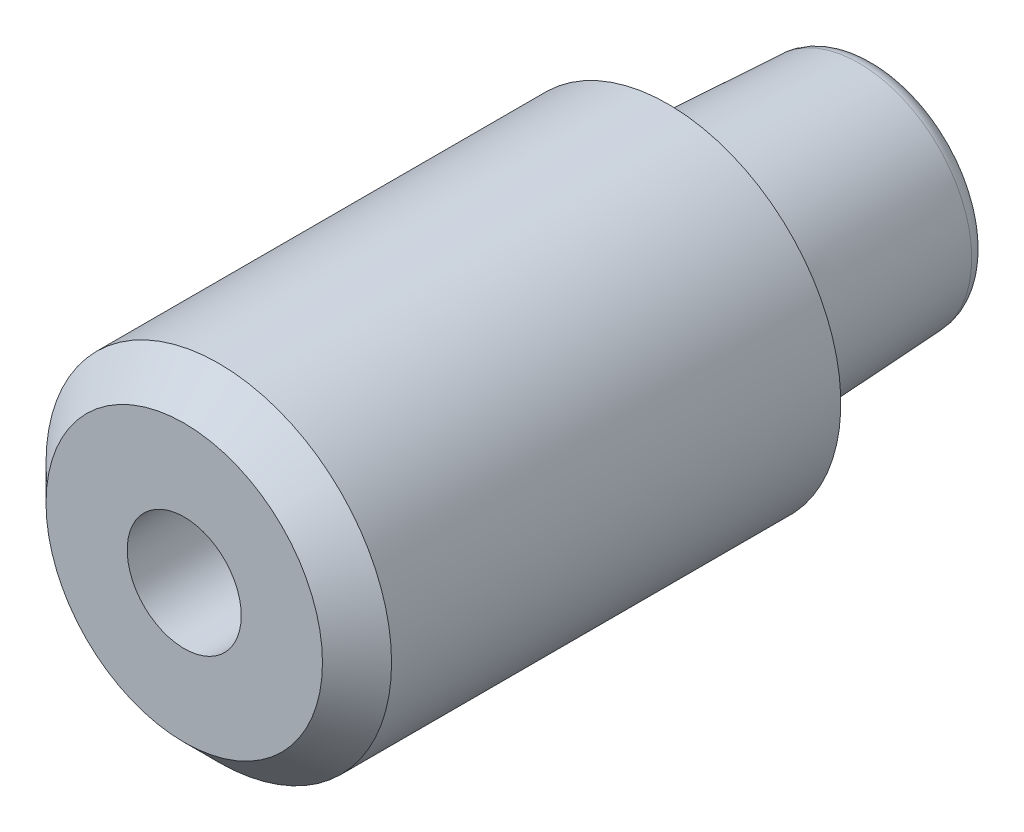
ISO-10303-21;
HEADER;
FILE_DESCRIPTION(('STEP AP214'),'2;1');
FILE_NAME('part.step','',(''),(''),'','','');
FILE_SCHEMA(('AUTOMOTIVE_DESIGN { 1 0 10303 214 1 1 1 1 }'));
ENDSEC;
DATA;
#1=APPLICATION_CONTEXT('core data for automotive mechanical design processes');
#2=APPLICATION_PROTOCOL_DEFINITION('international standard','automotive_design',2000,#1);
#3=PRODUCT_CONTEXT('',#1,'mechanical');
#4=PRODUCT('Part','Part','',(#3));
#5=PRODUCT_RELATED_PRODUCT_CATEGORY('part','',(#4));
#6=PRODUCT_DEFINITION_FORMATION('','',#4);
#7=PRODUCT_DEFINITION_CONTEXT('part definition',#1,'design');
#8=PRODUCT_DEFINITION('design','',#6,#7);
#9=PRODUCT_DEFINITION_SHAPE('','',#8);
#10=(LENGTH_UNIT() NAMED_UNIT(*) SI_UNIT(.MILLI.,.METRE.));
#11=(NAMED_UNIT(*) PLANE_ANGLE_UNIT() SI_UNIT($,.RADIAN.));
#12=(NAMED_UNIT(*) SI_UNIT($,.STERADIAN.) SOLID_ANGLE_UNIT());
#13=UNCERTAINTY_MEASURE_WITH_UNIT(LENGTH_MEASURE(1.E-05),#10,'distance_accuracy_value','');
#14=(GEOMETRIC_REPRESENTATION_CONTEXT(3) GLOBAL_UNCERTAINTY_ASSIGNED_CONTEXT((#13)) GLOBAL_UNIT_ASSIGNED_CONTEXT((#10,
#11,#12)) REPRESENTATION_CONTEXT('',''));
#15=CARTESIAN_POINT('',(0.,0.,0.));
#16=DIRECTION('',(0.,0.,1.));
#17=DIRECTION('',(1.,0.,0.));
#18=AXIS2_PLACEMENT_3D('',#15,#16,#17);
#19=CARTESIAN_POINT('',(0.,0.,11.9289321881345));
#20=DIRECTION('',(0.,0.,-1.));
#21=DIRECTION('',(1.,0.,0.));
#22=AXIS2_PLACEMENT_3D('',#19,#20,#21);
#23=CONICAL_SURFACE('',#22,7.07106781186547,0.785398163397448);
#24=CARTESIAN_POINT('',(1.04744440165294E-13,0.,15.));
#25=DIRECTION('',(0.,0.,-1.));
#26=DIRECTION('',(-1.,0.,0.));
#27=AXIS2_PLACEMENT_3D('',#24,#25,#26);
#28=CIRCLE('',#27,4.);
#29=CARTESIAN_POINT('',(-3.9999999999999,0.,15.));
#30=VERTEX_POINT('',#29);
#31=CARTESIAN_POINT('',(4.0000000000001,0.,15.));
#32=VERTEX_POINT('',#31);
#33=EDGE_CURVE('E59',#30,#32,#28,.T.);
#34=ORIENTED_EDGE('',*,*,#33,.T.);
#35=CARTESIAN_POINT('',(4.00000161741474,0.,14.9999983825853));
#36=CARTESIAN_POINT('',(5.00000126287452,0.,13.9999987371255));
#37=B_SPLINE_CURVE_WITH_KNOTS('',1,(#35,#36),.UNSPECIFIED.,.F.,.F.,(2,2),(0.56568565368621,
0.707106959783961),.UNSPECIFIED.);
#38=CARTESIAN_POINT('',(5.0000000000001,0.,14.));
#39=VERTEX_POINT('',#38);
#40=EDGE_CURVE('E46',#32,#39,#37,.T.);
#41=ORIENTED_EDGE('',*,*,#40,.T.);
#42=CARTESIAN_POINT('',(0.,0.,14.));
#43=DIRECTION('',(0.,0.,1.));
#44=DIRECTION('',(-1.,0.,0.));
#45=AXIS2_PLACEMENT_3D('',#42,#43,#44);
#46=CIRCLE('',#45,5.);
#47=CARTESIAN_POINT('',(-4.9999999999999,0.,14.));
#48=VERTEX_POINT('',#47);
#49=EDGE_CURVE('E97',#39,#48,#46,.T.);
#50=ORIENTED_EDGE('',*,*,#49,.T.);
#51=CARTESIAN_POINT('',(0.,0.,14.));
#52=DIRECTION('',(0.,0.,1.));
#53=DIRECTION('',(-1.,0.,0.));
#54=AXIS2_PLACEMENT_3D('',#51,#52,#53);
#55=CIRCLE('',#54,5.);
#56=EDGE_CURVE('E11',#48,#39,#55,.T.);
#57=ORIENTED_EDGE('',*,*,#56,.T.);
#58=ORIENTED_EDGE('',*,*,#40,.F.);
#59=CARTESIAN_POINT('',(1.04744440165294E-13,0.,15.));
#60=DIRECTION('',(0.,0.,-1.));
#61=DIRECTION('',(-1.,0.,0.));
#62=AXIS2_PLACEMENT_3D('',#59,#60,#61);
#63=CIRCLE('',#62,4.);
#64=EDGE_CURVE('E94',#32,#30,#63,.T.);
#65=ORIENTED_EDGE('',*,*,#64,.T.);
#66=EDGE_LOOP('',(#34,#41,#50,#57,#58,#65));
#67=FACE_BOUND('',#66,.T.);
#68=ADVANCED_FACE('F38',(#67),#23,.T.);
#69=CARTESIAN_POINT('',(0.,0.,8.));
#70=DIRECTION('',(0.,0.,-1.));
#71=DIRECTION('',(-1.,0.,0.));
#72=AXIS2_PLACEMENT_3D('',#69,#70,#71);
#73=CYLINDRICAL_SURFACE('',#72,5.);
#74=ORIENTED_EDGE('',*,*,#49,.F.);
#75=ORIENTED_EDGE('',*,*,#56,.F.);
#76=CARTESIAN_POINT('',(-4.9999999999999,0.,13.9999990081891));
#77=CARTESIAN_POINT('',(-5.,0.,0.999998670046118));
#78=B_SPLINE_CURVE_WITH_KNOTS('',1,(#76,#77),.UNSPECIFIED.,.F.,.F.,(2,2),(0.0833333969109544,
0.916666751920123),.UNSPECIFIED.);
#79=CARTESIAN_POINT('',(-5.,0.,1.00000000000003));
#80=VERTEX_POINT('',#79);
#81=EDGE_CURVE('E132',#48,#80,#78,.T.);
#82=ORIENTED_EDGE('',*,*,#81,.T.);
#83=CARTESIAN_POINT('',(0.,0.,1.));
#84=DIRECTION('',(0.,0.,-1.));
#85=DIRECTION('',(-1.,0.,0.));
#86=AXIS2_PLACEMENT_3D('',#83,#84,#85);
#87=CIRCLE('',#86,5.);
#88=EDGE_CURVE('E137',#80,#80,#87,.T.);
#89=ORIENTED_EDGE('',*,*,#88,.F.);
#90=ORIENTED_EDGE('',*,*,#81,.F.);
#91=EDGE_LOOP('',(#74,#75,#82,#89,#90));
#92=FACE_BOUND('',#91,.T.);
#93=ADVANCED_FACE('F182',(#92),#73,.T.);
#94=CARTESIAN_POINT('',(-5.1999999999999,-8.31384387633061,15.));
#95=DIRECTION('',(0.,0.,1.));
#96=DIRECTION('',(1.,0.,0.));
#97=AXIS2_PLACEMENT_3D('',#94,#95,#96);
#98=PLANE('',#97);
#99=CARTESIAN_POINT('',(0.,0.,15.));
#100=DIRECTION('',(0.,0.,1.));
#101=DIRECTION('',(1.,0.,0.));
#102=AXIS2_PLACEMENT_3D('',#99,#100,#101);
#103=CIRCLE('',#102,1.64999999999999);
#104=CARTESIAN_POINT('',(1.64999999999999,0.,15.));
#105=VERTEX_POINT('',#104);
#106=EDGE_CURVE('E95',#105,#105,#103,.T.);
#107=ORIENTED_EDGE('',*,*,#106,.F.);
#108=EDGE_LOOP('',(#107));
#109=FACE_BOUND('',#108,.T.);
#110=ORIENTED_EDGE('',*,*,#64,.F.);
#111=ORIENTED_EDGE('',*,*,#33,.F.);
#112=EDGE_LOOP('',(#110,#111));
#113=FACE_BOUND('',#112,.T.);
#114=ADVANCED_FACE('F185',(#109,#113),#98,.T.);
#115=CARTESIAN_POINT('',(0.,0.,-4.5));
#116=DIRECTION('',(0.,0.,-1.));
#117=DIRECTION('',(-1.,0.,0.));
#118=AXIS2_PLACEMENT_3D('',#115,#116,#117);
#119=TOROIDAL_SURFACE('',#118,2.76347882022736,0.5);
#120=CARTESIAN_POINT('',(0.,0.,-4.52616797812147));
#121=DIRECTION('',(0.,0.,-1.));
#122=DIRECTION('',(-1.,0.,0.));
#123=AXIS2_PLACEMENT_3D('',#120,#121,#122);
#124=CIRCLE('',#123,3.26279358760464);
#125=CARTESIAN_POINT('',(-3.26279358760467,0.,-4.52616797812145));
#126=VERTEX_POINT('',#125);
#127=EDGE_CURVE('E138',#126,#126,#124,.T.);
#128=ORIENTED_EDGE('',*,*,#127,.T.);
#129=CARTESIAN_POINT('',(-3.26279358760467,0.,-4.52616797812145));
#130=CARTESIAN_POINT('',(-3.23796110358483,0.,-4.99999999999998));
#131=CARTESIAN_POINT('',(-2.76347882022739,0.,-5.));
#132=(BOUNDED_CURVE() B_SPLINE_CURVE(2,(#129,#130,#131),.UNSPECIFIED.,.F.,
.F.) B_SPLINE_CURVE_WITH_KNOTS((3,3),(0.,0.5),
.UNSPECIFIED.) CURVE() GEOMETRIC_REPRESENTATION_ITEM() RATIONAL_B_SPLINE_CURVE((1.,
0.725374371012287,1.)) REPRESENTATION_ITEM(''));
#133=CARTESIAN_POINT('',(-2.76347882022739,0.,-5.));
#134=VERTEX_POINT('',#133);
#135=EDGE_CURVE('E121',#126,#134,#132,.T.);
#136=ORIENTED_EDGE('',*,*,#135,.T.);
#137=CARTESIAN_POINT('',(0.,0.,-5.));
#138=DIRECTION('',(0.,0.,1.));
#139=DIRECTION('',(-1.,0.,0.));
#140=AXIS2_PLACEMENT_3D('',#137,#138,#139);
#141=CIRCLE('',#140,2.76347882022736);
#142=EDGE_CURVE('E127',#134,#134,#141,.T.);
#143=ORIENTED_EDGE('',*,*,#142,.T.);
#144=ORIENTED_EDGE('',*,*,#135,.F.);
#145=EDGE_LOOP('',(#128,#136,#143,#144));
#146=FACE_BOUND('',#145,.T.);
#147=ADVANCED_FACE('F187',(#146),#119,.T.);
#148=CARTESIAN_POINT('',(0.,0.,0.));
#149=DIRECTION('',(0.,0.,1.));
#150=DIRECTION('',(-1.,0.,0.));
#151=AXIS2_PLACEMENT_3D('',#148,#149,#150);
#152=CONICAL_SURFACE('',#151,3.5,0.0523598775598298);
#153=ORIENTED_EDGE('',*,*,#127,.F.);
#154=CARTESIAN_POINT('',(-3.26279358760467,0.,-4.52616797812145));
#155=CARTESIAN_POINT('',(-3.5,0.,0.));
#156=B_SPLINE_CURVE_WITH_KNOTS('',1,(#154,#155),.UNSPECIFIED.,.F.,.F.,(2,2),(0.,1.),.UNSPECIFIED.);
#157=CARTESIAN_POINT('',(-3.5,0.,0.));
#158=VERTEX_POINT('',#157);
#159=EDGE_CURVE('E110',#126,#158,#156,.T.);
#160=ORIENTED_EDGE('',*,*,#159,.T.);
#161=CARTESIAN_POINT('',(0.,0.,0.));
#162=DIRECTION('',(0.,0.,-1.));
#163=DIRECTION('',(-1.,0.,0.));
#164=AXIS2_PLACEMENT_3D('',#161,#162,#163);
#165=CIRCLE('',#164,3.5);
#166=EDGE_CURVE('E116',#158,#158,#165,.T.);
#167=ORIENTED_EDGE('',*,*,#166,.T.);
#168=ORIENTED_EDGE('',*,*,#159,.F.);
#169=EDGE_LOOP('',(#153,#160,#167,#168));
#170=FACE_BOUND('',#169,.T.);
#171=ADVANCED_FACE('F194',(#170),#152,.T.);
#172=CARTESIAN_POINT('',(6.35600128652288,-5.74378286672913,-5.));
#173=DIRECTION('',(0.,0.,-1.));
#174=DIRECTION('',(-1.,0.,0.));
#175=AXIS2_PLACEMENT_3D('',#172,#173,#174);
#176=PLANE('',#175);
#177=ORIENTED_EDGE('',*,*,#142,.F.);
#178=EDGE_LOOP('',(#177));
#179=FACE_BOUND('',#178,.T.);
#180=ADVANCED_FACE('F222',(#179),#176,.T.);
#181=CARTESIAN_POINT('',(0.,0.,0.5));
#182=DIRECTION('',(0.,0.,-1.));
#183=DIRECTION('',(-1.,0.,0.));
#184=AXIS2_PLACEMENT_3D('',#181,#182,#183);
#185=CYLINDRICAL_SURFACE('',#184,3.5);
#186=CARTESIAN_POINT('',(0.,0.,1.));
#187=DIRECTION('',(0.,0.,1.));
#188=DIRECTION('',(-1.,0.,0.));
#189=AXIS2_PLACEMENT_3D('',#186,#187,#188);
#190=CIRCLE('',#189,3.5);
#191=CARTESIAN_POINT('',(-3.5,0.,1.00000000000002));
#192=VERTEX_POINT('',#191);
#193=EDGE_CURVE('E105',#192,#192,#190,.T.);
#194=ORIENTED_EDGE('',*,*,#193,.F.);
#195=CARTESIAN_POINT('',(-3.5,0.,1.00000305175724));
#196=CARTESIAN_POINT('',(-3.5,0.,5.31746900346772E-07));
#197=B_SPLINE_CURVE_WITH_KNOTS('',1,(#195,#196),.UNSPECIFIED.,.F.,.F.,(2,2),(0.0833307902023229,
0.91666622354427),.UNSPECIFIED.);
#198=EDGE_CURVE('E102',#192,#158,#197,.T.);
#199=ORIENTED_EDGE('',*,*,#198,.T.);
#200=ORIENTED_EDGE('',*,*,#166,.F.);
#201=ORIENTED_EDGE('',*,*,#198,.F.);
#202=EDGE_LOOP('',(#194,#199,#200,#201));
#203=FACE_BOUND('',#202,.T.);
#204=ADVANCED_FACE('F231',(#203),#185,.T.);
#205=CARTESIAN_POINT('',(11.5,-10.3923048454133,0.99999999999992));
#206=DIRECTION('',(0.,0.,-1.));
#207=DIRECTION('',(-1.,0.,0.));
#208=AXIS2_PLACEMENT_3D('',#205,#206,#207);
#209=PLANE('',#208);
#210=ORIENTED_EDGE('',*,*,#88,.T.);
#211=EDGE_LOOP('',(#210));
#212=FACE_BOUND('',#211,.T.);
#213=ORIENTED_EDGE('',*,*,#193,.T.);
#214=EDGE_LOOP('',(#213));
#215=FACE_BOUND('',#214,.T.);
#216=ADVANCED_FACE('F88',(#212,#215),#209,.T.);
#217=CARTESIAN_POINT('',(0.,0.,2.99999999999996));
#218=DIRECTION('',(0.,0.,1.));
#219=DIRECTION('',(1.,0.,0.));
#220=AXIS2_PLACEMENT_3D('',#217,#218,#219);
#221=CONICAL_SURFACE('',#220,1.65,1.02974425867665);
#222=CARTESIAN_POINT('',(0.,0.,2.00857997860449));
#223=VERTEX_POINT('',#222);
#224=VERTEX_LOOP('',#223);
#225=FACE_BOUND('',#224,.T.);
#226=CARTESIAN_POINT('',(0.,0.,2.99999999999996));
#227=DIRECTION('',(0.,0.,1.));
#228=DIRECTION('',(1.,0.,0.));
#229=AXIS2_PLACEMENT_3D('',#226,#227,#228);
#230=CIRCLE('',#229,1.65);
#231=CARTESIAN_POINT('',(1.65,0.,2.99999999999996));
#232=VERTEX_POINT('',#231);
#233=EDGE_CURVE('E92',#232,#232,#230,.T.);
#234=ORIENTED_EDGE('',*,*,#233,.T.);
#235=EDGE_LOOP('',(#234));
#236=FACE_BOUND('',#235,.T.);
#237=ADVANCED_FACE('F84',(#225,#236),#221,.F.);
#238=CARTESIAN_POINT('',(0.,0.,15.));
#239=DIRECTION('',(0.,0.,1.));
#240=DIRECTION('',(1.,0.,0.));
#241=AXIS2_PLACEMENT_3D('',#238,#239,#240);
#242=CYLINDRICAL_SURFACE('',#241,1.64999999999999);
#243=ORIENTED_EDGE('',*,*,#233,.F.);
#244=EDGE_LOOP('',(#243));
#245=FACE_BOUND('',#244,.T.);
#246=ORIENTED_EDGE('',*,*,#106,.T.);
#247=EDGE_LOOP('',(#246));
#248=FACE_BOUND('',#247,.T.);
#249=ADVANCED_FACE('F87',(#245,#248),#242,.F.);
#250=CLOSED_SHELL('',(#68,#93,#114,#147,#171,#180,#204,#216,#237,#249));
#251=MANIFOLD_SOLID_BREP('B2',#250);
#252=ADVANCED_BREP_SHAPE_REPRESENTATION('',(#18,#251),#14);
#253=SHAPE_DEFINITION_REPRESENTATION(#9,#252);
ENDSEC;
END-ISO-10303-21;
